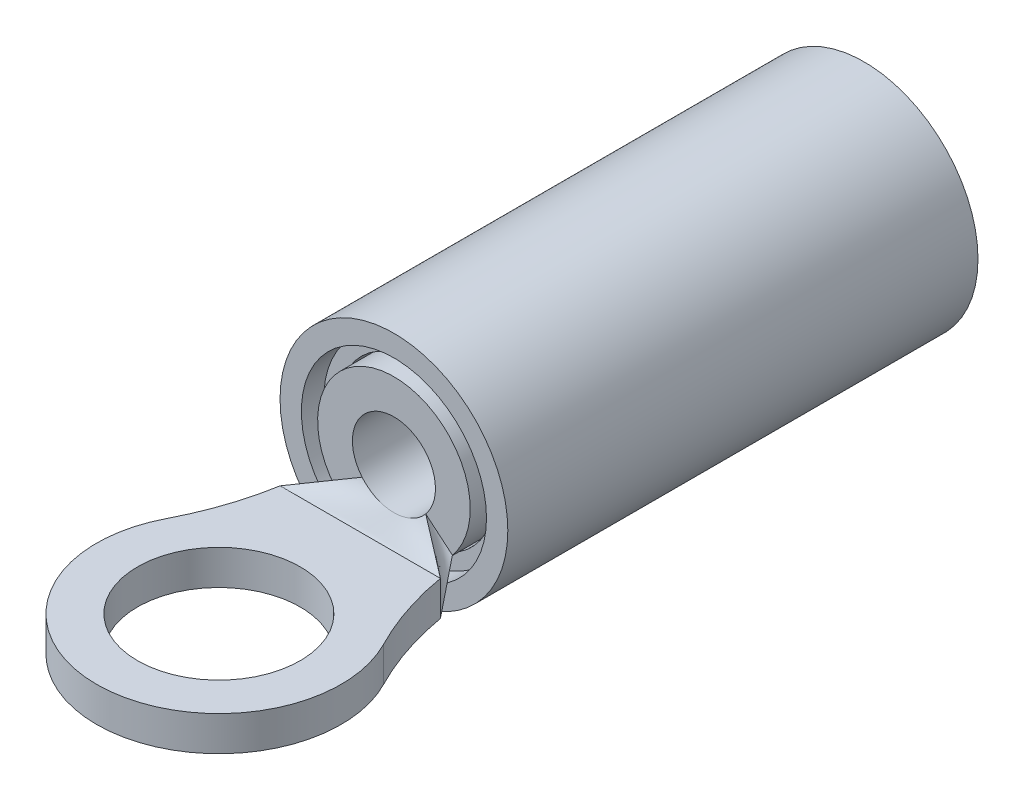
ISO-10303-21;
HEADER;
FILE_DESCRIPTION(('STEP AP214'),'2;1');
FILE_NAME('part.step','',(''),(''),'','','');
FILE_SCHEMA(('AUTOMOTIVE_DESIGN { 1 0 10303 214 1 1 1 1 }'));
ENDSEC;
DATA;
#1=APPLICATION_CONTEXT('core data for automotive mechanical design processes');
#2=APPLICATION_PROTOCOL_DEFINITION('international standard','automotive_design',2000,#1);
#3=PRODUCT_CONTEXT('',#1,'mechanical');
#4=PRODUCT('Part','Part','',(#3));
#5=PRODUCT_RELATED_PRODUCT_CATEGORY('part','',(#4));
#6=PRODUCT_DEFINITION_FORMATION('','',#4);
#7=PRODUCT_DEFINITION_CONTEXT('part definition',#1,'design');
#8=PRODUCT_DEFINITION('design','',#6,#7);
#9=PRODUCT_DEFINITION_SHAPE('','',#8);
#10=(LENGTH_UNIT() NAMED_UNIT(*) SI_UNIT(.MILLI.,.METRE.));
#11=(NAMED_UNIT(*) PLANE_ANGLE_UNIT() SI_UNIT($,.RADIAN.));
#12=(NAMED_UNIT(*) SI_UNIT($,.STERADIAN.) SOLID_ANGLE_UNIT());
#13=UNCERTAINTY_MEASURE_WITH_UNIT(LENGTH_MEASURE(1.E-05),#10,'distance_accuracy_value','');
#14=(GEOMETRIC_REPRESENTATION_CONTEXT(3) GLOBAL_UNCERTAINTY_ASSIGNED_CONTEXT((#13)) GLOBAL_UNIT_ASSIGNED_CONTEXT((#10,
#11,#12)) REPRESENTATION_CONTEXT('',''));
#15=CARTESIAN_POINT('',(0.,0.,0.));
#16=DIRECTION('',(0.,0.,1.));
#17=DIRECTION('',(1.,0.,0.));
#18=AXIS2_PLACEMENT_3D('',#15,#16,#17);
#19=CARTESIAN_POINT('',(1.897444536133,-0.01376722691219,-5.953196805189));
#20=CARTESIAN_POINT('',(1.71501432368,0.2166874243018,-6.217732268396));
#21=CARTESIAN_POINT('',(1.532584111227,0.4471420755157,-6.482267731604));
#22=CARTESIAN_POINT('',(1.350153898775,0.6775967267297,-6.746803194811));
#23=CARTESIAN_POINT('',(1.873013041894,-0.01343879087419,-5.953196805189));
#24=CARTESIAN_POINT('',(1.694684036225,0.2115180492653,-6.217732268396));
#25=CARTESIAN_POINT('',(1.516355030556,0.4364748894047,-6.482267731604));
#26=CARTESIAN_POINT('',(1.338026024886,0.6614317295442,-6.746803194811));
#27=CARTESIAN_POINT('',(1.543264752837,-0.009064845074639,-5.953196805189));
#28=CARTESIAN_POINT('',(1.419015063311,0.1426749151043,-6.217732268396));
#29=CARTESIAN_POINT('',(1.294765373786,0.2944146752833,-6.482267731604));
#30=CARTESIAN_POINT('',(1.17051568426,0.4461544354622,-6.746803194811));
#31=CARTESIAN_POINT('',(0.9101766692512,-0.002309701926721,-5.953196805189));
#32=CARTESIAN_POINT('',(0.8568906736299,0.03635324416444,-6.217732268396));
#33=CARTESIAN_POINT('',(0.8036046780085,0.0750161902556,-6.482267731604));
#34=CARTESIAN_POINT('',(0.7503186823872,0.1136791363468,-6.746803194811));
#35=CARTESIAN_POINT('',(0.,0.00115485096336,-5.953196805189));
#36=CARTESIAN_POINT('',(0.,-0.01817662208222,-6.217732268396));
#37=CARTESIAN_POINT('',(0.,-0.0375080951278,-6.482267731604));
#38=CARTESIAN_POINT('',(0.,-0.05683956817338,-6.746803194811));
#39=CARTESIAN_POINT('',(-0.9101766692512,-0.002309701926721,-5.953196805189));
#40=CARTESIAN_POINT('',(-0.8568906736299,0.03635324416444,-6.217732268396));
#41=CARTESIAN_POINT('',(-0.8036046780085,0.0750161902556,-6.482267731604));
#42=CARTESIAN_POINT('',(-0.7503186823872,0.1136791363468,-6.746803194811));
#43=CARTESIAN_POINT('',(-1.543264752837,-0.009064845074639,-5.953196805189));
#44=CARTESIAN_POINT('',(-1.419015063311,0.1426749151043,-6.217732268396));
#45=CARTESIAN_POINT('',(-1.294765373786,0.2944146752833,-6.482267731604));
#46=CARTESIAN_POINT('',(-1.17051568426,0.4461544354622,-6.746803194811));
#47=CARTESIAN_POINT('',(-1.873013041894,-0.01343879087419,-5.953196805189));
#48=CARTESIAN_POINT('',(-1.694684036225,0.2115180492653,-6.217732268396));
#49=CARTESIAN_POINT('',(-1.516355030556,0.4364748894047,-6.482267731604));
#50=CARTESIAN_POINT('',(-1.338026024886,0.6614317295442,-6.746803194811));
#51=CARTESIAN_POINT('',(-1.897444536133,-0.01376722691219,-5.953196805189));
#52=CARTESIAN_POINT('',(-1.71501432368,0.2166874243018,-6.217732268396));
#53=CARTESIAN_POINT('',(-1.532584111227,0.4471420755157,-6.482267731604));
#54=CARTESIAN_POINT('',(-1.350153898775,0.6775967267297,-6.746803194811));
#55=B_SPLINE_SURFACE_WITH_KNOTS('',3,3,((#19,#20,#21,#22),(#23,#24,#25,#26),(#27,#28,#29,#30),
(#31,#32,#33,#34),(#35,#36,#37,#38),(#39,#40,#41,#42),(#43,#44,#45,#46),(#47,#48,#49,#50),(#51,
#52,#53,#54)),.UNSPECIFIED.,.F.,.F.,.F.,(4,1,1,1,1,1,4),(4,4),(-0.02,0.,0.25,0.5,0.75,1.,1.02),
(-0.0207391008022,1.020739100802),.UNSPECIFIED.);
#56=DIRECTION('',(0.447683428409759,-0.562690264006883,0.694952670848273));
#57=VECTOR('',#56,1.);
#58=CARTESIAN_POINT('',(1.56854937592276,0.308488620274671,-6.35));
#59=LINE('',#58,#57);
#60=CARTESIAN_POINT('',(1.32311196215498,0.616977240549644,-6.73100000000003));
#61=VERTEX_POINT('',#60);
#62=CARTESIAN_POINT('',(1.81398678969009,0.,-5.96900000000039));
#63=VERTEX_POINT('',#62);
#64=EDGE_CURVE('P0_E100',#61,#63,#59,.T.);
#65=DIRECTION('',(1.,0.,0.));
#66=VECTOR('',#65,1.);
#67=CARTESIAN_POINT('',(0.,0.,-5.969));
#68=LINE('',#67,#66);
#69=CARTESIAN_POINT('',(-1.81398678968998,-2.52727526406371E-13,-5.96900000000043));
#70=VERTEX_POINT('',#69);
#71=EDGE_CURVE('P0_E97',#63,#70,#68,.F.);
#72=DIRECTION('',(0.44768342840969,0.562690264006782,-0.6949526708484));
#73=VECTOR('',#72,1.);
#74=CARTESIAN_POINT('',(-1.56854937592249,0.308488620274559,-6.35));
#75=LINE('',#74,#73);
#76=CARTESIAN_POINT('',(-1.32311196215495,0.616977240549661,-6.73100000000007));
#77=VERTEX_POINT('',#76);
#78=EDGE_CURVE('P0_E84',#70,#77,#75,.T.);
#79=CARTESIAN_POINT('',(-1.36105217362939,0.663829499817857,-6.73100000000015));
#80=CARTESIAN_POINT('',(-1.34867929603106,0.647992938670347,-6.73100000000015));
#81=CARTESIAN_POINT('',(-1.1779382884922,0.437089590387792,-6.73100000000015));
#82=CARTESIAN_POINT('',(-0.753501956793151,0.111369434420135,-6.73100000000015));
#83=CARTESIAN_POINT('',(0.,-0.0556847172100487,-6.73100000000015));
#84=CARTESIAN_POINT('',(0.753501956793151,0.111369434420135,-6.73100000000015));
#85=CARTESIAN_POINT('',(1.1779382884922,0.437089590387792,-6.73100000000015));
#86=CARTESIAN_POINT('',(1.34867929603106,0.647992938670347,-6.73100000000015));
#87=CARTESIAN_POINT('',(1.36105217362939,0.663829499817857,-6.73100000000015));
#88=B_SPLINE_CURVE_WITH_KNOTS('',3,(#79,#80,#81,#82,#83,#84,#85,#86,#87),.UNSPECIFIED.,.F.,.F.,
(4,1,1,1,1,1,4),(-0.02,0.,0.25,0.5,0.75,1.,1.02),.UNSPECIFIED.);
#89=CARTESIAN_POINT('',(0.,0.,-6.73100000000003));
#90=VERTEX_POINT('',#89);
#91=EDGE_CURVE('P0_E94',#77,#90,#88,.T.);
#92=CARTESIAN_POINT('',(-1.36105217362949,0.663829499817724,-6.731));
#93=CARTESIAN_POINT('',(-1.34867929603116,0.647992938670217,-6.731));
#94=CARTESIAN_POINT('',(-1.17793828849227,0.437089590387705,-6.731));
#95=CARTESIAN_POINT('',(-0.753501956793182,0.111369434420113,-6.731));
#96=CARTESIAN_POINT('',(0.,-0.0556847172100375,-6.731));
#97=CARTESIAN_POINT('',(0.753501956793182,0.111369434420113,-6.731));
#98=CARTESIAN_POINT('',(1.17793828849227,0.437089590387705,-6.731));
#99=CARTESIAN_POINT('',(1.34867929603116,0.647992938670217,-6.731));
#100=CARTESIAN_POINT('',(1.36105217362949,0.663829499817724,-6.731));
#101=B_SPLINE_CURVE_WITH_KNOTS('',3,(#92,#93,#94,#95,#96,#97,#98,#99,#100),.UNSPECIFIED.,.F.,
.F.,(4,1,1,1,1,1,4),(-0.02,0.,0.25,0.5,0.75,1.,1.02),.UNSPECIFIED.);
#102=EDGE_CURVE('P0_E123',#90,#61,#101,.T.);
#103=ORIENTED_EDGE('',*,*,#64,.T.);
#104=ORIENTED_EDGE('',*,*,#71,.T.);
#105=ORIENTED_EDGE('',*,*,#78,.T.);
#106=ORIENTED_EDGE('',*,*,#91,.T.);
#107=ORIENTED_EDGE('',*,*,#102,.T.);
#108=EDGE_LOOP('',(#103,#104,#105,#106,#107));
#109=FACE_BOUND('',#108,.T.);
#110=ADVANCED_FACE('P0_F16',(#109),#55,.T.);
#111=CARTESIAN_POINT('',(0.,0.,0.));
#112=DIRECTION('',(0.,1.,0.));
#113=DIRECTION('',(0.,0.,1.));
#114=AXIS2_PLACEMENT_3D('',#111,#112,#113);
#115=PLANE('',#114);
#116=CARTESIAN_POINT('',(0.,0.,-2.7686));
#117=DIRECTION('',(0.,1.,0.));
#118=DIRECTION('',(0.,0.,1.));
#119=AXIS2_PLACEMENT_3D('',#116,#117,#118);
#120=CIRCLE('',#119,1.8415);
#121=CARTESIAN_POINT('',(0.,0.,-0.9271));
#122=VERTEX_POINT('',#121);
#123=EDGE_CURVE('P0_E227',#122,#122,#120,.T.);
#124=ORIENTED_EDGE('',*,*,#123,.T.);
#125=EDGE_LOOP('',(#124));
#126=FACE_BOUND('',#125,.T.);
#127=ORIENTED_EDGE('',*,*,#71,.F.);
#128=CARTESIAN_POINT('',(8.422217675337,0.,-7.107576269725));
#129=DIRECTION('',(0.,1.,0.));
#130=DIRECTION('',(0.,0.,1.));
#131=AXIS2_PLACEMENT_3D('',#128,#129,#130);
#132=CIRCLE('',#131,6.7056);
#133=CARTESIAN_POINT('',(2.46118425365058,0.,-4.0365582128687));
#134=VERTEX_POINT('',#133);
#135=EDGE_CURVE('P0_E231',#63,#134,#132,.T.);
#136=ORIENTED_EDGE('',*,*,#135,.T.);
#137=CARTESIAN_POINT('',(0.,0.,-2.7686));
#138=DIRECTION('',(0.,1.,0.));
#139=DIRECTION('',(0.,0.,1.));
#140=AXIS2_PLACEMENT_3D('',#137,#138,#139);
#141=CIRCLE('',#140,2.7686);
#142=CARTESIAN_POINT('',(-2.46118425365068,0.,-4.03655821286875));
#143=VERTEX_POINT('',#142);
#144=EDGE_CURVE('P0_E106',#143,#134,#141,.T.);
#145=ORIENTED_EDGE('',*,*,#144,.F.);
#146=CARTESIAN_POINT('',(-8.422217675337,0.,-7.107576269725));
#147=DIRECTION('',(0.,1.,0.));
#148=DIRECTION('',(0.,0.,1.));
#149=AXIS2_PLACEMENT_3D('',#146,#147,#148);
#150=CIRCLE('',#149,6.7056);
#151=EDGE_CURVE('P0_E77',#143,#70,#150,.T.);
#152=ORIENTED_EDGE('',*,*,#151,.T.);
#153=EDGE_LOOP('',(#127,#136,#145,#152));
#154=FACE_BOUND('',#153,.T.);
#155=ADVANCED_FACE('P0_F104',(#126,#154),#115,.F.);
#156=CARTESIAN_POINT('',(-8.422217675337,0.,-7.107576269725));
#157=DIRECTION('',(0.,1.,0.));
#158=DIRECTION('',(0.,0.,1.));
#159=AXIS2_PLACEMENT_3D('',#156,#157,#158);
#160=CYLINDRICAL_SURFACE('',#159,6.7056);
#161=DIRECTION('',(0.,1.,0.));
#162=VECTOR('',#161,1.);
#163=CARTESIAN_POINT('',(-2.46118425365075,0.,-4.03655821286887));
#164=LINE('',#163,#162);
#165=CARTESIAN_POINT('',(-2.46118425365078,0.7874,-4.0365582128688));
#166=VERTEX_POINT('',#165);
#167=EDGE_CURVE('P0_E108',#166,#143,#164,.F.);
#168=ORIENTED_EDGE('',*,*,#167,.F.);
#169=CARTESIAN_POINT('',(-8.422217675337,0.7874,-7.107576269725));
#170=DIRECTION('',(0.,1.,0.));
#171=DIRECTION('',(0.,0.,1.));
#172=AXIS2_PLACEMENT_3D('',#169,#170,#171);
#173=CIRCLE('',#172,6.7056);
#174=CARTESIAN_POINT('',(-1.81398678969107,0.787400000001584,-5.96899999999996));
#175=VERTEX_POINT('',#174);
#176=EDGE_CURVE('P0_E112',#175,#166,#173,.F.);
#177=ORIENTED_EDGE('',*,*,#176,.F.);
#178=DIRECTION('',(0.,1.,0.));
#179=VECTOR('',#178,1.);
#180=CARTESIAN_POINT('',(-1.81398678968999,0.,-5.969));
#181=LINE('',#180,#179);
#182=EDGE_CURVE('P0_E88',#70,#175,#181,.T.);
#183=ORIENTED_EDGE('',*,*,#182,.F.);
#184=ORIENTED_EDGE('',*,*,#151,.F.);
#185=EDGE_LOOP('',(#168,#177,#183,#184));
#186=FACE_BOUND('',#185,.T.);
#187=ADVANCED_FACE('P0_F110',(#186),#160,.F.);
#188=CARTESIAN_POINT('',(0.,0.,-2.7686));
#189=DIRECTION('',(0.,1.,0.));
#190=DIRECTION('',(0.,0.,1.));
#191=AXIS2_PLACEMENT_3D('',#188,#189,#190);
#192=CYLINDRICAL_SURFACE('',#191,2.7686);
#193=ORIENTED_EDGE('',*,*,#167,.T.);
#194=ORIENTED_EDGE('',*,*,#144,.T.);
#195=DIRECTION('',(0.,1.,0.));
#196=VECTOR('',#195,1.);
#197=CARTESIAN_POINT('',(2.46118425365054,0.,-4.03655821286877));
#198=LINE('',#197,#196);
#199=CARTESIAN_POINT('',(2.46118425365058,0.7874,-4.0365582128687));
#200=VERTEX_POINT('',#199);
#201=EDGE_CURVE('P0_E230',#134,#200,#198,.T.);
#202=ORIENTED_EDGE('',*,*,#201,.T.);
#203=CARTESIAN_POINT('',(0.,0.7874,-2.7686));
#204=DIRECTION('',(0.,1.,0.));
#205=DIRECTION('',(0.,0.,1.));
#206=AXIS2_PLACEMENT_3D('',#203,#204,#205);
#207=CIRCLE('',#206,2.7686);
#208=EDGE_CURVE('P0_E223',#166,#200,#207,.T.);
#209=ORIENTED_EDGE('',*,*,#208,.F.);
#210=EDGE_LOOP('',(#193,#194,#202,#209));
#211=FACE_BOUND('',#210,.T.);
#212=ADVANCED_FACE('P0_F237',(#211),#192,.T.);
#213=CARTESIAN_POINT('',(8.422217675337,0.,-7.107576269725));
#214=DIRECTION('',(0.,1.,0.));
#215=DIRECTION('',(0.,0.,1.));
#216=AXIS2_PLACEMENT_3D('',#213,#214,#215);
#217=CYLINDRICAL_SURFACE('',#216,6.7056);
#218=ORIENTED_EDGE('',*,*,#201,.F.);
#219=ORIENTED_EDGE('',*,*,#135,.F.);
#220=DIRECTION('',(0.,1.,0.));
#221=VECTOR('',#220,1.);
#222=CARTESIAN_POINT('',(1.81398678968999,0.,-5.969));
#223=LINE('',#222,#221);
#224=CARTESIAN_POINT('',(1.81398678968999,0.787399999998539,-5.969));
#225=VERTEX_POINT('',#224);
#226=EDGE_CURVE('P0_E233',#225,#63,#223,.F.);
#227=ORIENTED_EDGE('',*,*,#226,.F.);
#228=CARTESIAN_POINT('',(8.422217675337,0.7874,-7.107576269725));
#229=DIRECTION('',(0.,1.,0.));
#230=DIRECTION('',(0.,0.,1.));
#231=AXIS2_PLACEMENT_3D('',#228,#229,#230);
#232=CIRCLE('',#231,6.7056);
#233=EDGE_CURVE('P0_E220',#200,#225,#232,.F.);
#234=ORIENTED_EDGE('',*,*,#233,.F.);
#235=EDGE_LOOP('',(#218,#219,#227,#234));
#236=FACE_BOUND('',#235,.T.);
#237=ADVANCED_FACE('P0_F284',(#236),#217,.F.);
#238=CARTESIAN_POINT('',(0.,0.,-2.7686));
#239=DIRECTION('',(0.,1.,0.));
#240=DIRECTION('',(0.,0.,1.));
#241=AXIS2_PLACEMENT_3D('',#238,#239,#240);
#242=CYLINDRICAL_SURFACE('',#241,1.8415);
#243=CARTESIAN_POINT('',(0.,0.7874,-2.7686));
#244=DIRECTION('',(0.,1.,0.));
#245=DIRECTION('',(0.,0.,1.));
#246=AXIS2_PLACEMENT_3D('',#243,#244,#245);
#247=CIRCLE('',#246,1.8415);
#248=CARTESIAN_POINT('',(0.,0.7874,-0.9271));
#249=VERTEX_POINT('',#248);
#250=EDGE_CURVE('P0_E216',#249,#249,#247,.F.);
#251=ORIENTED_EDGE('',*,*,#250,.F.);
#252=EDGE_LOOP('',(#251));
#253=FACE_BOUND('',#252,.T.);
#254=ORIENTED_EDGE('',*,*,#123,.F.);
#255=EDGE_LOOP('',(#254));
#256=FACE_BOUND('',#255,.T.);
#257=ADVANCED_FACE('P0_F280',(#253,#256),#242,.F.);
#258=CARTESIAN_POINT('',(0.,0.7874,0.));
#259=DIRECTION('',(0.,1.,0.));
#260=DIRECTION('',(0.,0.,1.));
#261=AXIS2_PLACEMENT_3D('',#258,#259,#260);
#262=PLANE('',#261);
#263=ORIENTED_EDGE('',*,*,#250,.T.);
#264=EDGE_LOOP('',(#263));
#265=FACE_BOUND('',#264,.T.);
#266=ORIENTED_EDGE('',*,*,#208,.T.);
#267=ORIENTED_EDGE('',*,*,#233,.T.);
#268=DIRECTION('',(1.,6.09644029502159E-13,0.));
#269=VECTOR('',#268,1.);
#270=CARTESIAN_POINT('',(0.,0.7874,-5.969));
#271=LINE('',#270,#269);
#272=EDGE_CURVE('P0_E219',#175,#225,#271,.T.);
#273=ORIENTED_EDGE('',*,*,#272,.F.);
#274=ORIENTED_EDGE('',*,*,#176,.T.);
#275=EDGE_LOOP('',(#266,#267,#273,#274));
#276=FACE_BOUND('',#275,.T.);
#277=ADVANCED_FACE('P0_F240',(#265,#276),#262,.T.);
#278=CARTESIAN_POINT('',(-1.909465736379,0.7801759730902,-5.95376));
#279=CARTESIAN_POINT('',(-1.512194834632,0.9053924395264,-6.21792));
#280=CARTESIAN_POINT('',(-1.114923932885,1.030608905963,-6.48208));
#281=CARTESIAN_POINT('',(-0.7176530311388,1.155825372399,-6.74624));
#282=CARTESIAN_POINT('',(-1.88493016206,0.780348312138,-5.95376));
#283=CARTESIAN_POINT('',(-1.493710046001,0.9025775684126,-6.21792));
#284=CARTESIAN_POINT('',(-1.102489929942,1.024806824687,-6.48208));
#285=CARTESIAN_POINT('',(-0.7112698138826,1.147036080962,-6.74624));
#286=CARTESIAN_POINT('',(-1.553740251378,0.7826434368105,-5.95376));
#287=CARTESIAN_POINT('',(-1.243506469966,0.8650905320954,-6.21792));
#288=CARTESIAN_POINT('',(-0.9332726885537,0.9475376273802,-6.48208));
#289=CARTESIAN_POINT('',(-0.6230389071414,1.029984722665,-6.74624));
#290=CARTESIAN_POINT('',(-0.9169333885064,0.7861880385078,-5.95376));
#291=CARTESIAN_POINT('',(-0.7446401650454,0.8071953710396,-6.21792));
#292=CARTESIAN_POINT('',(-0.5723469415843,0.8282027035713,-6.48208));
#293=CARTESIAN_POINT('',(-0.4000537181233,0.8492100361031,-6.74624));
#294=CARTESIAN_POINT('',(0.,0.7880059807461,-5.95376));
#295=CARTESIAN_POINT('',(0.,0.7775023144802,-6.21792));
#296=CARTESIAN_POINT('',(0.,0.7669986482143,-6.48208));
#297=CARTESIAN_POINT('',(0.,0.7564949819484,-6.74624));
#298=CARTESIAN_POINT('',(0.9169333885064,0.7861880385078,-5.95376));
#299=CARTESIAN_POINT('',(0.7446401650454,0.8071953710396,-6.21792));
#300=CARTESIAN_POINT('',(0.5723469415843,0.8282027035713,-6.48208));
#301=CARTESIAN_POINT('',(0.4000537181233,0.8492100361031,-6.74624));
#302=CARTESIAN_POINT('',(1.553740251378,0.7826434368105,-5.95376));
#303=CARTESIAN_POINT('',(1.243506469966,0.8650905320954,-6.21792));
#304=CARTESIAN_POINT('',(0.9332726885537,0.9475376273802,-6.48208));
#305=CARTESIAN_POINT('',(0.6230389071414,1.029984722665,-6.74624));
#306=CARTESIAN_POINT('',(1.88493016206,0.780348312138,-5.95376));
#307=CARTESIAN_POINT('',(1.493710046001,0.9025775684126,-6.21792));
#308=CARTESIAN_POINT('',(1.102489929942,1.024806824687,-6.48208));
#309=CARTESIAN_POINT('',(0.7112698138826,1.147036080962,-6.74624));
#310=CARTESIAN_POINT('',(1.909465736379,0.7801759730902,-5.95376));
#311=CARTESIAN_POINT('',(1.512194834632,0.9053924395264,-6.21792));
#312=CARTESIAN_POINT('',(1.114923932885,1.030608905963,-6.48208));
#313=CARTESIAN_POINT('',(0.7176530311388,1.155825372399,-6.74624));
#314=B_SPLINE_SURFACE_WITH_KNOTS('',3,3,((#278,#279,#280,#281),(#282,#283,#284,#285),(#286,#287,
#288,#289),(#290,#291,#292,#293),(#294,#295,#296,#297),(#298,#299,#300,#301),(#302,#303,#304,
#305),(#306,#307,#308,#309),(#310,#311,#312,#313)),.UNSPECIFIED.,.F.,.F.,.F.,(4,1,1,1,1,1,4),(4,
4),(-0.02,0.,0.25,0.5,0.75,1.,1.02),(-0.02,1.02),.UNSPECIFIED.);
#315=DIRECTION('',(0.795745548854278,0.244171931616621,-0.554228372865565));
#316=VECTOR('',#315,1.);
#317=CARTESIAN_POINT('',(-1.26695767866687,0.955254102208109,-6.35));
#318=LINE('',#317,#316);
#319=CARTESIAN_POINT('',(-0.719928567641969,1.1231082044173,-6.73100000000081));
#320=VERTEX_POINT('',#319);
#321=EDGE_CURVE('P0_E241',#175,#320,#318,.T.);
#322=DIRECTION('',(0.795745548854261,-0.244171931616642,0.55422837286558));
#323=VECTOR('',#322,1.);
#324=CARTESIAN_POINT('',(1.2669576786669,0.955254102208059,-6.35));
#325=LINE('',#324,#323);
#326=CARTESIAN_POINT('',(0.719928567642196,1.12310820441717,-6.73100000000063));
#327=VERTEX_POINT('',#326);
#328=EDGE_CURVE('P0_E39',#327,#225,#325,.T.);
#329=CARTESIAN_POINT('',(0.740572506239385,1.14860134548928,-6.73100000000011));
#330=CARTESIAN_POINT('',(0.733840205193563,1.13998439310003,-6.73100000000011));
#331=CARTESIAN_POINT('',(0.640937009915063,1.02522815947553,-6.73100000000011));
#332=CARTESIAN_POINT('',(0.409993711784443,0.847998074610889,-6.73100000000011));
#333=CARTESIAN_POINT('',(0.,0.757100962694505,-6.73100000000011));
#334=CARTESIAN_POINT('',(-0.409993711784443,0.847998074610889,-6.73100000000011));
#335=CARTESIAN_POINT('',(-0.640937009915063,1.02522815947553,-6.73100000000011));
#336=CARTESIAN_POINT('',(-0.733840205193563,1.13998439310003,-6.73100000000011));
#337=CARTESIAN_POINT('',(-0.740572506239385,1.14860134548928,-6.73100000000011));
#338=B_SPLINE_CURVE_WITH_KNOTS('',3,(#329,#330,#331,#332,#333,#334,#335,#336,#337),
.UNSPECIFIED.,.F.,.F.,(4,1,1,1,1,1,4),(-0.02,0.,0.25,0.5,0.75,1.,1.02),.UNSPECIFIED.);
#339=CARTESIAN_POINT('',(0.,0.787399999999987,-6.73100000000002));
#340=VERTEX_POINT('',#339);
#341=EDGE_CURVE('P0_E193',#327,#340,#338,.T.);
#342=CARTESIAN_POINT('',(0.740572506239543,1.14860134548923,-6.731));
#343=CARTESIAN_POINT('',(0.733840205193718,1.13998439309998,-6.731));
#344=CARTESIAN_POINT('',(0.640937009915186,1.02522815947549,-6.731));
#345=CARTESIAN_POINT('',(0.409993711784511,0.847998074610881,-6.731));
#346=CARTESIAN_POINT('',(0.,0.75710096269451,-6.731));
#347=CARTESIAN_POINT('',(-0.409993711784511,0.847998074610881,-6.731));
#348=CARTESIAN_POINT('',(-0.640937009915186,1.02522815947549,-6.731));
#349=CARTESIAN_POINT('',(-0.733840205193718,1.13998439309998,-6.731));
#350=CARTESIAN_POINT('',(-0.740572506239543,1.14860134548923,-6.731));
#351=B_SPLINE_CURVE_WITH_KNOTS('',3,(#342,#343,#344,#345,#346,#347,#348,#349,#350),
.UNSPECIFIED.,.F.,.F.,(4,1,1,1,1,1,4),(-0.02,0.,0.25,0.5,0.75,1.,1.02),.UNSPECIFIED.);
#352=EDGE_CURVE('P0_E199',#340,#320,#351,.T.);
#353=ORIENTED_EDGE('',*,*,#321,.F.);
#354=ORIENTED_EDGE('',*,*,#272,.T.);
#355=ORIENTED_EDGE('',*,*,#328,.F.);
#356=ORIENTED_EDGE('',*,*,#341,.T.);
#357=ORIENTED_EDGE('',*,*,#352,.T.);
#358=EDGE_LOOP('',(#353,#354,#355,#356,#357));
#359=FACE_BOUND('',#358,.T.);
#360=ADVANCED_FACE('P0_F144',(#359),#314,.T.);
#361=CARTESIAN_POINT('',(-1.823805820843,-0.03570397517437,-5.953196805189));
#362=CARTESIAN_POINT('',(-1.659441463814,0.1813054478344,-6.217732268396));
#363=CARTESIAN_POINT('',(-1.495077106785,0.3983148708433,-6.482267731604));
#364=CARTESIAN_POINT('',(-1.330712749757,0.6153242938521,-6.746803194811));
#365=CARTESIAN_POINT('',(-1.823926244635,-0.02806783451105,-5.953196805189));
#366=CARTESIAN_POINT('',(-1.657546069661,0.1880015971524,-6.217732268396));
#367=CARTESIAN_POINT('',(-1.491165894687,0.4040710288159,-6.482267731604));
#368=CARTESIAN_POINT('',(-1.324785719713,0.6201404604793,-6.746803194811));
#369=CARTESIAN_POINT('',(-1.828216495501,0.2439793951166,-5.953196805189));
#370=CARTESIAN_POINT('',(-1.590020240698,0.426560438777,-6.217732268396));
#371=CARTESIAN_POINT('',(-1.351823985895,0.6091414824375,-6.482267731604));
#372=CARTESIAN_POINT('',(-1.113627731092,0.791722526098,-6.746803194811));
#373=CARTESIAN_POINT('',(-1.83262717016,0.5236627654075,-5.953196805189));
#374=CARTESIAN_POINT('',(-1.520599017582,0.6718154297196,-6.217732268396));
#375=CARTESIAN_POINT('',(-1.208570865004,0.8199680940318,-6.482267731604));
#376=CARTESIAN_POINT('',(-0.8965427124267,0.9681207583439,-6.746803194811));
#377=CARTESIAN_POINT('',(-1.836917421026,0.7957099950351,-5.953196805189));
#378=CARTESIAN_POINT('',(-1.453073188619,0.9103742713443,-6.217732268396));
#379=CARTESIAN_POINT('',(-1.069228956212,1.025038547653,-6.482267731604));
#380=CARTESIAN_POINT('',(-0.6853847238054,1.139702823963,-6.746803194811));
#381=CARTESIAN_POINT('',(-1.837037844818,0.8033461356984,-5.953196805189));
#382=CARTESIAN_POINT('',(-1.451177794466,0.9170704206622,-6.217732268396));
#383=CARTESIAN_POINT('',(-1.065317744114,1.030794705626,-6.482267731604));
#384=CARTESIAN_POINT('',(-0.6794576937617,1.14451899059,-6.746803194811));
#385=B_SPLINE_SURFACE_WITH_KNOTS('',3,3,((#361,#362,#363,#364),(#365,#366,#367,#368),(#369,#370,
#371,#372),(#373,#374,#375,#376),(#377,#378,#379,#380),(#381,#382,#383,#384)),.UNSPECIFIED.,.F.,
.F.,.F.,(4,1,1,4),(4,4),(-0.02887980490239,0.,1.,1.028879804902),(-0.0207391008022,
1.020739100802),.UNSPECIFIED.);
#386=DIRECTION('',(0.766044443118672,0.642787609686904,0.));
#387=VECTOR('',#386,1.);
#388=CARTESIAN_POINT('',(-1.323111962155,0.6169772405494,-6.731));
#389=LINE('',#388,#387);
#390=EDGE_CURVE('P0_E91',#77,#320,#389,.T.);
#391=ORIENTED_EDGE('',*,*,#78,.F.);
#392=ORIENTED_EDGE('',*,*,#182,.T.);
#393=ORIENTED_EDGE('',*,*,#321,.T.);
#394=ORIENTED_EDGE('',*,*,#390,.F.);
#395=EDGE_LOOP('',(#391,#392,#393,#394));
#396=FACE_BOUND('',#395,.T.);
#397=ADVANCED_FACE('P0_F86',(#396),#385,.T.);
#398=CARTESIAN_POINT('',(1.837037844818,0.8033461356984,-5.953196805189));
#399=CARTESIAN_POINT('',(1.451177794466,0.9170704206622,-6.217732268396));
#400=CARTESIAN_POINT('',(1.065317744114,1.030794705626,-6.482267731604));
#401=CARTESIAN_POINT('',(0.6794576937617,1.14451899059,-6.746803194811));
#402=CARTESIAN_POINT('',(1.836917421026,0.7957099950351,-5.953196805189));
#403=CARTESIAN_POINT('',(1.453073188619,0.9103742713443,-6.217732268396));
#404=CARTESIAN_POINT('',(1.069228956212,1.025038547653,-6.482267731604));
#405=CARTESIAN_POINT('',(0.6853847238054,1.139702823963,-6.746803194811));
#406=CARTESIAN_POINT('',(1.83262717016,0.5236627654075,-5.953196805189));
#407=CARTESIAN_POINT('',(1.520599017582,0.6718154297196,-6.217732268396));
#408=CARTESIAN_POINT('',(1.208570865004,0.8199680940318,-6.482267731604));
#409=CARTESIAN_POINT('',(0.8965427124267,0.9681207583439,-6.746803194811));
#410=CARTESIAN_POINT('',(1.828216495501,0.2439793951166,-5.953196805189));
#411=CARTESIAN_POINT('',(1.590020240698,0.426560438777,-6.217732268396));
#412=CARTESIAN_POINT('',(1.351823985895,0.6091414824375,-6.482267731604));
#413=CARTESIAN_POINT('',(1.113627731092,0.791722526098,-6.746803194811));
#414=CARTESIAN_POINT('',(1.823926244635,-0.02806783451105,-5.953196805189));
#415=CARTESIAN_POINT('',(1.657546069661,0.1880015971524,-6.217732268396));
#416=CARTESIAN_POINT('',(1.491165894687,0.4040710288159,-6.482267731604));
#417=CARTESIAN_POINT('',(1.324785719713,0.6201404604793,-6.746803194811));
#418=CARTESIAN_POINT('',(1.823805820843,-0.03570397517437,-5.953196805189));
#419=CARTESIAN_POINT('',(1.659441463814,0.1813054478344,-6.217732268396));
#420=CARTESIAN_POINT('',(1.495077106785,0.3983148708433,-6.482267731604));
#421=CARTESIAN_POINT('',(1.330712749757,0.6153242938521,-6.746803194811));
#422=B_SPLINE_SURFACE_WITH_KNOTS('',3,3,((#398,#399,#400,#401),(#402,#403,#404,#405),(#406,#407,
#408,#409),(#410,#411,#412,#413),(#414,#415,#416,#417),(#418,#419,#420,#421)),.UNSPECIFIED.,.F.,
.F.,.F.,(4,1,1,4),(4,4),(-0.02887980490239,0.,1.,1.028879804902),(-0.0207391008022,
1.020739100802),.UNSPECIFIED.);
#423=DIRECTION('',(0.766044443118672,-0.642787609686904,0.));
#424=VECTOR('',#423,1.);
#425=CARTESIAN_POINT('',(0.7199285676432,1.123108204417,-6.731));
#426=LINE('',#425,#424);
#427=EDGE_CURVE('P0_E204',#327,#61,#426,.T.);
#428=ORIENTED_EDGE('',*,*,#427,.F.);
#429=ORIENTED_EDGE('',*,*,#328,.T.);
#430=ORIENTED_EDGE('',*,*,#226,.T.);
#431=ORIENTED_EDGE('',*,*,#64,.F.);
#432=EDGE_LOOP('',(#428,#429,#430,#431));
#433=FACE_BOUND('',#432,.T.);
#434=ADVANCED_FACE('P0_F18',(#433),#422,.T.);
#435=CARTESIAN_POINT('',(0.,1.7272,-11.07821));
#436=DIRECTION('',(0.,0.,1.));
#437=DIRECTION('',(1.,0.,0.));
#438=AXIS2_PLACEMENT_3D('',#435,#436,#437);
#439=CYLINDRICAL_SURFACE('',#438,0.9398);
#440=CARTESIAN_POINT('',(0.,1.7272,-10.8712));
#441=DIRECTION('',(0.,0.,1.));
#442=DIRECTION('',(1.,0.,0.));
#443=AXIS2_PLACEMENT_3D('',#440,#441,#442);
#444=CIRCLE('',#443,0.9398);
#445=CARTESIAN_POINT('',(0.9398,1.7272,-10.8712));
#446=VERTEX_POINT('',#445);
#447=EDGE_CURVE('P0_E206',#446,#446,#444,.F.);
#448=ORIENTED_EDGE('',*,*,#447,.T.);
#449=EDGE_LOOP('',(#448));
#450=FACE_BOUND('',#449,.T.);
#451=CARTESIAN_POINT('',(0.,1.7272,-6.731));
#452=DIRECTION('',(0.,0.,1.));
#453=DIRECTION('',(1.,0.,0.));
#454=AXIS2_PLACEMENT_3D('',#451,#452,#453);
#455=CIRCLE('',#454,0.9398);
#456=EDGE_CURVE('P0_E197',#320,#327,#455,.F.);
#457=ORIENTED_EDGE('',*,*,#456,.F.);
#458=ORIENTED_EDGE('',*,*,#352,.F.);
#459=ORIENTED_EDGE('',*,*,#341,.F.);
#460=EDGE_LOOP('',(#457,#458,#459));
#461=FACE_BOUND('',#460,.T.);
#462=ADVANCED_FACE('P0_F195',(#450,#461),#439,.F.);
#463=CARTESIAN_POINT('',(0.,1.7272,-6.731));
#464=DIRECTION('',(0.,0.,1.));
#465=DIRECTION('',(1.,0.,0.));
#466=AXIS2_PLACEMENT_3D('',#463,#464,#465);
#467=PLANE('',#466);
#468=ORIENTED_EDGE('',*,*,#456,.T.);
#469=ORIENTED_EDGE('',*,*,#427,.T.);
#470=CARTESIAN_POINT('',(0.,1.7272,-6.731));
#471=DIRECTION('',(0.,0.,1.));
#472=DIRECTION('',(1.,0.,0.));
#473=AXIS2_PLACEMENT_3D('',#470,#471,#472);
#474=CIRCLE('',#473,1.7272);
#475=EDGE_CURVE('P0_E30',#77,#61,#474,.F.);
#476=ORIENTED_EDGE('',*,*,#475,.F.);
#477=ORIENTED_EDGE('',*,*,#390,.T.);
#478=EDGE_LOOP('',(#468,#469,#476,#477));
#479=FACE_BOUND('',#478,.T.);
#480=ADVANCED_FACE('P0_F208',(#479),#467,.T.);
#481=CARTESIAN_POINT('',(0.,1.7272,-10.8712));
#482=DIRECTION('',(0.,0.,1.));
#483=DIRECTION('',(1.,0.,0.));
#484=AXIS2_PLACEMENT_3D('',#481,#482,#483);
#485=PLANE('',#484);
#486=ORIENTED_EDGE('',*,*,#447,.F.);
#487=EDGE_LOOP('',(#486));
#488=FACE_BOUND('',#487,.T.);
#489=CARTESIAN_POINT('',(0.,1.7272,-10.8712));
#490=DIRECTION('',(0.,0.,1.));
#491=DIRECTION('',(1.,0.,0.));
#492=AXIS2_PLACEMENT_3D('',#489,#490,#491);
#493=CIRCLE('',#492,1.7272);
#494=CARTESIAN_POINT('',(1.7272,1.7272,-10.8712));
#495=VERTEX_POINT('',#494);
#496=EDGE_CURVE('P0_E11',#495,#495,#493,.T.);
#497=ORIENTED_EDGE('',*,*,#496,.F.);
#498=EDGE_LOOP('',(#497));
#499=FACE_BOUND('',#498,.T.);
#500=ADVANCED_FACE('P0_F178',(#488,#499),#485,.F.);
#501=CARTESIAN_POINT('',(0.,1.7272,-11.07821));
#502=DIRECTION('',(0.,0.,1.));
#503=DIRECTION('',(1.,0.,0.));
#504=AXIS2_PLACEMENT_3D('',#501,#502,#503);
#505=CYLINDRICAL_SURFACE('',#504,1.7272);
#506=ORIENTED_EDGE('',*,*,#496,.T.);
#507=EDGE_LOOP('',(#506));
#508=FACE_BOUND('',#507,.T.);
#509=ORIENTED_EDGE('',*,*,#475,.T.);
#510=ORIENTED_EDGE('',*,*,#102,.F.);
#511=ORIENTED_EDGE('',*,*,#91,.F.);
#512=EDGE_LOOP('',(#509,#510,#511));
#513=FACE_BOUND('',#512,.T.);
#514=ADVANCED_FACE('P0_F169',(#508,#513),#505,.T.);
#515=CLOSED_SHELL('',(#110,#155,#187,#212,#237,#257,#277,#360,#397,#434,#462,#480,#500,#514));
#516=MANIFOLD_SOLID_BREP('P0_B1',#515);
#517=CARTESIAN_POINT('',(0.,1.7272,-11.6586));
#518=DIRECTION('',(0.,0.,1.));
#519=DIRECTION('',(1.,0.,0.));
#520=AXIS2_PLACEMENT_3D('',#517,#518,#519);
#521=PLANE('',#520);
#522=CARTESIAN_POINT('',(0.,1.7272,-11.6586));
#523=DIRECTION('',(0.,0.,1.));
#524=DIRECTION('',(1.,0.,0.));
#525=AXIS2_PLACEMENT_3D('',#522,#523,#524);
#526=CIRCLE('',#525,1.7653);
#527=CARTESIAN_POINT('',(1.7653,1.7272,-11.6586));
#528=VERTEX_POINT('',#527);
#529=EDGE_CURVE('P1_E16',#528,#528,#526,.T.);
#530=ORIENTED_EDGE('',*,*,#529,.T.);
#531=EDGE_LOOP('',(#530));
#532=FACE_BOUND('',#531,.T.);
#533=ADVANCED_FACE('P1_F13',(#532),#521,.T.);
#534=CARTESIAN_POINT('',(0.,1.7272,-17.90573));
#535=DIRECTION('',(0.,0.,1.));
#536=DIRECTION('',(1.,0.,0.));
#537=AXIS2_PLACEMENT_3D('',#534,#535,#536);
#538=CYLINDRICAL_SURFACE('',#537,1.7653);
#539=ORIENTED_EDGE('',*,*,#529,.F.);
#540=EDGE_LOOP('',(#539));
#541=FACE_BOUND('',#540,.T.);
#542=CARTESIAN_POINT('',(0.,1.7272,-7.239));
#543=DIRECTION('',(0.,0.,1.));
#544=DIRECTION('',(1.,0.,0.));
#545=AXIS2_PLACEMENT_3D('',#542,#543,#544);
#546=CIRCLE('',#545,1.7653);
#547=CARTESIAN_POINT('',(1.7653,1.7272,-7.239));
#548=VERTEX_POINT('',#547);
#549=EDGE_CURVE('P1_E38',#548,#548,#546,.F.);
#550=ORIENTED_EDGE('',*,*,#549,.F.);
#551=EDGE_LOOP('',(#550));
#552=FACE_BOUND('',#551,.T.);
#553=ADVANCED_FACE('P1_F46',(#541,#552),#538,.F.);
#554=CARTESIAN_POINT('',(0.,1.7272,-7.239));
#555=DIRECTION('',(0.,0.,1.));
#556=DIRECTION('',(1.,0.,0.));
#557=AXIS2_PLACEMENT_3D('',#554,#555,#556);
#558=PLANE('',#557);
#559=ORIENTED_EDGE('',*,*,#549,.T.);
#560=EDGE_LOOP('',(#559));
#561=FACE_BOUND('',#560,.T.);
#562=CARTESIAN_POINT('',(0.,1.7272,-7.239));
#563=DIRECTION('',(0.,0.,1.));
#564=DIRECTION('',(1.,0.,0.));
#565=AXIS2_PLACEMENT_3D('',#562,#563,#564);
#566=CIRCLE('',#565,2.0955);
#567=CARTESIAN_POINT('',(2.0955,1.7272,-7.239));
#568=VERTEX_POINT('',#567);
#569=EDGE_CURVE('P1_E36',#568,#568,#566,.T.);
#570=ORIENTED_EDGE('',*,*,#569,.T.);
#571=EDGE_LOOP('',(#570));
#572=FACE_BOUND('',#571,.T.);
#573=ADVANCED_FACE('P1_F49',(#561,#572),#558,.T.);
#574=CARTESIAN_POINT('',(0.,1.7272,-16.2687));
#575=DIRECTION('',(0.,0.,1.));
#576=DIRECTION('',(1.,0.,0.));
#577=AXIS2_PLACEMENT_3D('',#574,#575,#576);
#578=PLANE('',#577);
#579=CARTESIAN_POINT('',(0.,1.7272,-16.2687));
#580=DIRECTION('',(0.,0.,1.));
#581=DIRECTION('',(1.,0.,0.));
#582=AXIS2_PLACEMENT_3D('',#579,#580,#581);
#583=CIRCLE('',#582,2.0955);
#584=CARTESIAN_POINT('',(2.0955,1.7272,-16.2687));
#585=VERTEX_POINT('',#584);
#586=EDGE_CURVE('P1_E33',#585,#585,#583,.F.);
#587=ORIENTED_EDGE('',*,*,#586,.T.);
#588=EDGE_LOOP('',(#587));
#589=FACE_BOUND('',#588,.T.);
#590=ADVANCED_FACE('P1_F55',(#589),#578,.F.);
#591=CARTESIAN_POINT('',(0.,1.7272,-17.90573));
#592=DIRECTION('',(0.,0.,1.));
#593=DIRECTION('',(1.,0.,0.));
#594=AXIS2_PLACEMENT_3D('',#591,#592,#593);
#595=CYLINDRICAL_SURFACE('',#594,2.0955);
#596=ORIENTED_EDGE('',*,*,#569,.F.);
#597=EDGE_LOOP('',(#596));
#598=FACE_BOUND('',#597,.T.);
#599=CARTESIAN_POINT('',(0.,1.7272,-6.731));
#600=DIRECTION('',(0.,0.,1.));
#601=DIRECTION('',(1.,0.,0.));
#602=AXIS2_PLACEMENT_3D('',#599,#600,#601);
#603=CIRCLE('',#602,2.0955);
#604=CARTESIAN_POINT('',(2.0955,1.7272,-6.731));
#605=VERTEX_POINT('',#604);
#606=EDGE_CURVE('P1_E30',#605,#605,#603,.F.);
#607=ORIENTED_EDGE('',*,*,#606,.F.);
#608=EDGE_LOOP('',(#607));
#609=FACE_BOUND('',#608,.T.);
#610=ADVANCED_FACE('P1_F75',(#598,#609),#595,.F.);
#611=CARTESIAN_POINT('',(0.,1.7272,-17.90573));
#612=DIRECTION('',(0.,0.,1.));
#613=DIRECTION('',(1.,0.,0.));
#614=AXIS2_PLACEMENT_3D('',#611,#612,#613);
#615=CYLINDRICAL_SURFACE('',#614,2.0955);
#616=ORIENTED_EDGE('',*,*,#586,.F.);
#617=EDGE_LOOP('',(#616));
#618=FACE_BOUND('',#617,.T.);
#619=CARTESIAN_POINT('',(0.,1.7272,-17.3736));
#620=DIRECTION('',(0.,0.,1.));
#621=DIRECTION('',(1.,0.,0.));
#622=AXIS2_PLACEMENT_3D('',#619,#620,#621);
#623=CIRCLE('',#622,2.0955);
#624=CARTESIAN_POINT('',(2.0955,1.7272,-17.3736));
#625=VERTEX_POINT('',#624);
#626=EDGE_CURVE('P1_E25',#625,#625,#623,.F.);
#627=ORIENTED_EDGE('',*,*,#626,.T.);
#628=EDGE_LOOP('',(#627));
#629=FACE_BOUND('',#628,.T.);
#630=ADVANCED_FACE('P1_F71',(#618,#629),#615,.F.);
#631=CARTESIAN_POINT('',(0.,1.7272,-6.731));
#632=DIRECTION('',(0.,0.,1.));
#633=DIRECTION('',(1.,0.,0.));
#634=AXIS2_PLACEMENT_3D('',#631,#632,#633);
#635=PLANE('',#634);
#636=ORIENTED_EDGE('',*,*,#606,.T.);
#637=EDGE_LOOP('',(#636));
#638=FACE_BOUND('',#637,.T.);
#639=CARTESIAN_POINT('',(0.,1.7272,-6.731));
#640=DIRECTION('',(0.,0.,1.));
#641=DIRECTION('',(1.,0.,0.));
#642=AXIS2_PLACEMENT_3D('',#639,#640,#641);
#643=CIRCLE('',#642,2.5781);
#644=CARTESIAN_POINT('',(2.5781,1.7272,-6.731));
#645=VERTEX_POINT('',#644);
#646=EDGE_CURVE('P1_E20',#645,#645,#643,.F.);
#647=ORIENTED_EDGE('',*,*,#646,.F.);
#648=EDGE_LOOP('',(#647));
#649=FACE_BOUND('',#648,.T.);
#650=ADVANCED_FACE('P1_F64',(#638,#649),#635,.T.);
#651=CARTESIAN_POINT('',(0.,1.7272,-17.3736));
#652=DIRECTION('',(0.,0.,1.));
#653=DIRECTION('',(1.,0.,0.));
#654=AXIS2_PLACEMENT_3D('',#651,#652,#653);
#655=PLANE('',#654);
#656=ORIENTED_EDGE('',*,*,#626,.F.);
#657=EDGE_LOOP('',(#656));
#658=FACE_BOUND('',#657,.T.);
#659=CARTESIAN_POINT('',(0.,1.7272,-17.3736));
#660=DIRECTION('',(0.,0.,1.));
#661=DIRECTION('',(1.,0.,0.));
#662=AXIS2_PLACEMENT_3D('',#659,#660,#661);
#663=CIRCLE('',#662,2.5781);
#664=CARTESIAN_POINT('',(2.5781,1.7272,-17.3736));
#665=VERTEX_POINT('',#664);
#666=EDGE_CURVE('P1_E9',#665,#665,#663,.T.);
#667=ORIENTED_EDGE('',*,*,#666,.F.);
#668=EDGE_LOOP('',(#667));
#669=FACE_BOUND('',#668,.T.);
#670=ADVANCED_FACE('P1_F59',(#658,#669),#655,.F.);
#671=CARTESIAN_POINT('',(0.,1.7272,-17.90573));
#672=DIRECTION('',(0.,0.,1.));
#673=DIRECTION('',(1.,0.,0.));
#674=AXIS2_PLACEMENT_3D('',#671,#672,#673);
#675=CYLINDRICAL_SURFACE('',#674,2.5781);
#676=ORIENTED_EDGE('',*,*,#666,.T.);
#677=EDGE_LOOP('',(#676));
#678=FACE_BOUND('',#677,.T.);
#679=ORIENTED_EDGE('',*,*,#646,.T.);
#680=EDGE_LOOP('',(#679));
#681=FACE_BOUND('',#680,.T.);
#682=ADVANCED_FACE('P1_F57',(#678,#681),#675,.T.);
#683=CLOSED_SHELL('',(#533,#553,#573,#590,#610,#630,#650,#670,#682));
#684=MANIFOLD_SOLID_BREP('P1_B1',#683);
#685=ADVANCED_BREP_SHAPE_REPRESENTATION('',(#18,#516,#684),#14);
#686=SHAPE_DEFINITION_REPRESENTATION(#9,#685);
ENDSEC;
END-ISO-10303-21;
